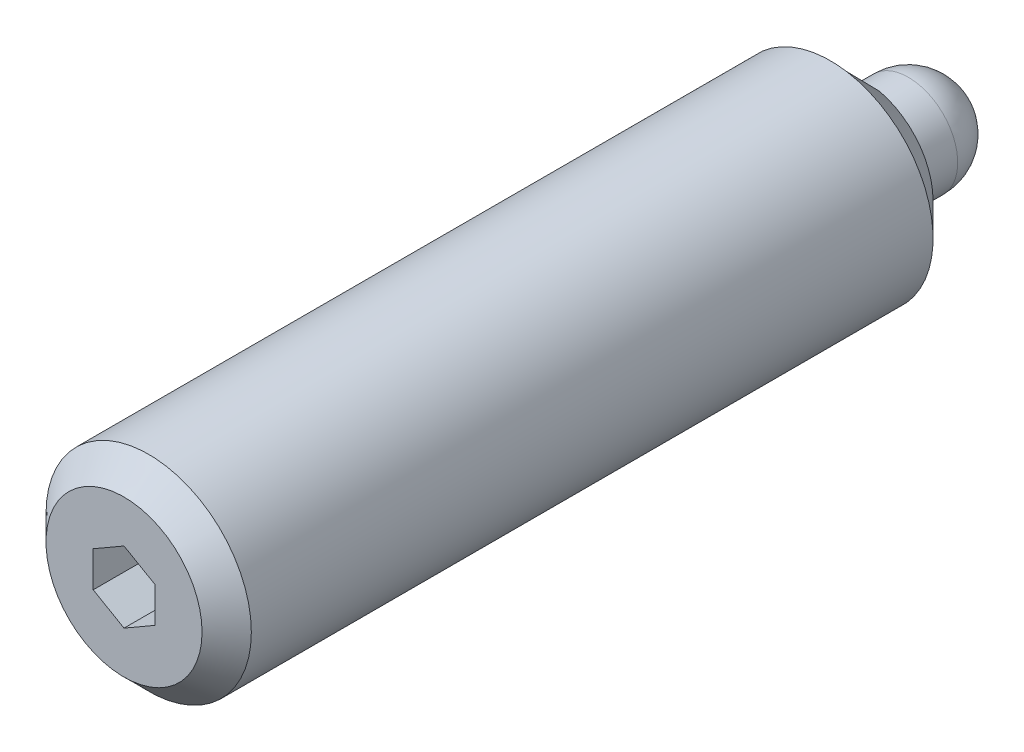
ISO-10303-21;
HEADER;
FILE_DESCRIPTION(('STEP AP214'),'2;1');
FILE_NAME('part.step','',(''),(''),'','','');
FILE_SCHEMA(('AUTOMOTIVE_DESIGN { 1 0 10303 214 1 1 1 1 }'));
ENDSEC;
DATA;
#1=APPLICATION_CONTEXT('core data for automotive mechanical design processes');
#2=APPLICATION_PROTOCOL_DEFINITION('international standard','automotive_design',2000,#1);
#3=PRODUCT_CONTEXT('',#1,'mechanical');
#4=PRODUCT('Part','Part','',(#3));
#5=PRODUCT_RELATED_PRODUCT_CATEGORY('part','',(#4));
#6=PRODUCT_DEFINITION_FORMATION('','',#4);
#7=PRODUCT_DEFINITION_CONTEXT('part definition',#1,'design');
#8=PRODUCT_DEFINITION('design','',#6,#7);
#9=PRODUCT_DEFINITION_SHAPE('','',#8);
#10=(LENGTH_UNIT() NAMED_UNIT(*) SI_UNIT(.MILLI.,.METRE.));
#11=(NAMED_UNIT(*) PLANE_ANGLE_UNIT() SI_UNIT($,.RADIAN.));
#12=(NAMED_UNIT(*) SI_UNIT($,.STERADIAN.) SOLID_ANGLE_UNIT());
#13=UNCERTAINTY_MEASURE_WITH_UNIT(LENGTH_MEASURE(1.E-05),#10,'distance_accuracy_value','');
#14=(GEOMETRIC_REPRESENTATION_CONTEXT(3) GLOBAL_UNCERTAINTY_ASSIGNED_CONTEXT((#13)) GLOBAL_UNIT_ASSIGNED_CONTEXT((#10,
#11,#12)) REPRESENTATION_CONTEXT('',''));
#15=CARTESIAN_POINT('',(0.,0.,0.));
#16=DIRECTION('',(0.,0.,1.));
#17=DIRECTION('',(1.,0.,0.));
#18=AXIS2_PLACEMENT_3D('',#15,#16,#17);
#19=CARTESIAN_POINT('',(0.,1.2,2.3));
#20=DIRECTION('',(0.,0.,-1.));
#21=DIRECTION('',(-1.,0.,0.));
#22=AXIS2_PLACEMENT_3D('',#19,#20,#21);
#23=PLANE('',#22);
#24=DIRECTION('',(0.,-1.,0.));
#25=VECTOR('',#24,1.);
#26=CARTESIAN_POINT('',(0.4,-1.13137084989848,2.3));
#27=LINE('',#26,#25);
#28=CARTESIAN_POINT('',(0.4,-1.13137084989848,2.3));
#29=VERTEX_POINT('',#28);
#30=CARTESIAN_POINT('',(0.4,-1.65227116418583,2.3));
#31=VERTEX_POINT('',#30);
#32=EDGE_CURVE('E129',#29,#31,#27,.T.);
#33=ORIENTED_EDGE('',*,*,#32,.F.);
#34=CARTESIAN_POINT('',(0.,0.,2.3));
#35=DIRECTION('',(0.,0.,-1.));
#36=DIRECTION('',(-1.,0.,0.));
#37=AXIS2_PLACEMENT_3D('',#34,#35,#36);
#38=CIRCLE('',#37,1.2);
#39=CARTESIAN_POINT('',(0.4,1.13137084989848,2.3));
#40=VERTEX_POINT('',#39);
#41=EDGE_CURVE('E218',#40,#29,#38,.T.);
#42=ORIENTED_EDGE('',*,*,#41,.F.);
#43=DIRECTION('',(0.,-1.,0.));
#44=VECTOR('',#43,1.);
#45=CARTESIAN_POINT('',(0.4,2.66147052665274,2.3));
#46=LINE('',#45,#44);
#47=CARTESIAN_POINT('',(0.4,1.65227116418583,2.3));
#48=VERTEX_POINT('',#47);
#49=EDGE_CURVE('E148',#48,#40,#46,.T.);
#50=ORIENTED_EDGE('',*,*,#49,.F.);
#51=CARTESIAN_POINT('',(0.,0.,2.3));
#52=DIRECTION('',(0.,0.,-1.));
#53=DIRECTION('',(-1.,0.,0.));
#54=AXIS2_PLACEMENT_3D('',#51,#52,#53);
#55=CIRCLE('',#54,1.7);
#56=EDGE_CURVE('E221',#48,#31,#55,.T.);
#57=ORIENTED_EDGE('',*,*,#56,.T.);
#58=EDGE_LOOP('',(#33,#42,#50,#57));
#59=FACE_BOUND('',#58,.T.);
#60=ADVANCED_FACE('F14',(#59),#23,.T.);
#61=CARTESIAN_POINT('',(0.,0.,2.3));
#62=DIRECTION('',(0.,0.,1.));
#63=DIRECTION('',(1.,0.,0.));
#64=AXIS2_PLACEMENT_3D('',#61,#62,#63);
#65=CONICAL_SURFACE('',#64,1.7,0.785398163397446);
#66=CARTESIAN_POINT('',(0.4,-0.191542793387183,1.04349593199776));
#67=CARTESIAN_POINT('',(0.4,-0.207169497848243,1.05025345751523));
#68=CARTESIAN_POINT('',(0.4,-0.222543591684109,1.0575560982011));
#69=CARTESIAN_POINT('',(0.4,-0.252830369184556,1.07302458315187));
#70=CARTESIAN_POINT('',(0.4,-0.267743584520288,1.08118938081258));
#71=CARTESIAN_POINT('',(0.4,-0.311804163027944,1.10660136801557));
#72=CARTESIAN_POINT('',(0.4,-0.340386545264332,1.12481911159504));
#73=CARTESIAN_POINT('',(0.4,-0.396328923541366,1.16272382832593));
#74=CARTESIAN_POINT('',(0.4,-0.423694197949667,1.18240320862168));
#75=CARTESIAN_POINT('',(0.4,-0.477696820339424,1.22279626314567));
#76=CARTESIAN_POINT('',(0.4,-0.504333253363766,1.24351115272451));
#77=CARTESIAN_POINT('',(0.4,-0.582677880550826,1.30606006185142));
#78=CARTESIAN_POINT('',(0.4,-0.633607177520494,1.34886298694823));
#79=CARTESIAN_POINT('',(0.4,-0.734309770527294,1.43581262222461));
#80=CARTESIAN_POINT('',(0.4,-0.784082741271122,1.4799597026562));
#81=CARTESIAN_POINT('',(0.4,-0.882911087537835,1.56905853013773));
#82=CARTESIAN_POINT('',(0.4,-0.931966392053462,1.61401035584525));
#83=CARTESIAN_POINT('',(0.4,-1.02959776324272,1.70441687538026));
#84=CARTESIAN_POINT('',(0.4,-1.07817389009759,1.74987150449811));
#85=CARTESIAN_POINT('',(0.4,-1.22393832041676,1.88722420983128));
#86=CARTESIAN_POINT('',(0.4,-1.32064296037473,1.97963490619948));
#87=CARTESIAN_POINT('',(0.4,-1.51336883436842,2.16512702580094));
#88=CARTESIAN_POINT('',(0.4,-1.60939019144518,2.25820832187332));
#89=CARTESIAN_POINT('',(0.4,-1.7416596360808,2.38698356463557));
#90=CARTESIAN_POINT('',(0.4,-1.77808020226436,2.42250037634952));
#91=CARTESIAN_POINT('',(0.4,-1.85082095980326,2.4935356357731));
#92=CARTESIAN_POINT('',(0.4,-1.88714122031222,2.52905401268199));
#93=CARTESIAN_POINT('',(0.4,-2.06005543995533,2.69834373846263));
#94=CARTESIAN_POINT('',(0.4,-2.19638243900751,2.83238773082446));
#95=CARTESIAN_POINT('',(0.4,-2.46871289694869,3.10080511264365));
#96=CARTESIAN_POINT('',(0.4,-2.60471635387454,3.23517850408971));
#97=CARTESIAN_POINT('',(0.4,-2.87740114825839,3.5050031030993));
#98=CARTESIAN_POINT('',(0.4,-3.01408116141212,3.64045564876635));
#99=CARTESIAN_POINT('',(0.4,-3.28729767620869,3.91150273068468));
#100=CARTESIAN_POINT('',(0.4,-3.42383417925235,4.04709726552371));
#101=CARTESIAN_POINT('',(0.4,-3.56033160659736,4.18273096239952));
#102=B_SPLINE_CURVE_WITH_KNOTS('',3,(#66,#67,#68,#69,#70,#71,#72,#73,#74,#75,#76,#77,#78,#79,
#80,#81,#82,#83,#84,#85,#86,#87,#88,#89,#90,#91,#92,#93,#94,#95,#96,#97,#98,#99,#100,#101),
.UNSPECIFIED.,.F.,.F.,(4,2,2,2,2,2,2,2,2,2,2,2,2,2,2,2,2,4),(0.,0.0510423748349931,
0.102023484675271,0.203610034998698,0.304701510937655,0.405914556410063,0.605442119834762,
0.805025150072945,1.00462779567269,1.20420504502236,1.60547397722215,2.00666872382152,
2.1592829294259,2.31168514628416,2.88524779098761,3.45881390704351,4.03609997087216,
4.61338034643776),.UNSPECIFIED.);
#103=CARTESIAN_POINT('',(0.4,-2.46779253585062,3.1));
#104=VERTEX_POINT('',#103);
#105=EDGE_CURVE('E9',#31,#104,#102,.T.);
#106=ORIENTED_EDGE('',*,*,#105,.F.);
#107=ORIENTED_EDGE('',*,*,#56,.F.);
#108=CARTESIAN_POINT('',(0.4,3.24418869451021,3.86875515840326));
#109=CARTESIAN_POINT('',(0.4,3.11988874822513,3.74540033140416));
#110=CARTESIAN_POINT('',(0.4,2.995545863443,3.62208860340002));
#111=CARTESIAN_POINT('',(0.4,2.74671089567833,3.37562755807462));
#112=CARTESIAN_POINT('',(0.4,2.62221882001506,3.25247823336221));
#113=CARTESIAN_POINT('',(0.4,2.37304205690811,3.00643777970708));
#114=CARTESIAN_POINT('',(0.4,2.24835742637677,2.88354659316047));
#115=CARTESIAN_POINT('',(0.4,1.99862225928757,2.63812396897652));
#116=CARTESIAN_POINT('',(0.4,1.87357170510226,2.51559254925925));
#117=CARTESIAN_POINT('',(0.4,1.65089891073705,2.29852648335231));
#118=CARTESIAN_POINT('',(0.4,1.5534018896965,2.20386364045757));
#119=CARTESIAN_POINT('',(0.4,1.40667255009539,2.06238260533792));
#120=CARTESIAN_POINT('',(0.4,1.35768510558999,2.01531062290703));
#121=CARTESIAN_POINT('',(0.4,1.25948508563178,1.92139904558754));
#122=CARTESIAN_POINT('',(0.4,1.21027250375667,1.8745594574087));
#123=CARTESIAN_POINT('',(0.4,1.1115171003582,1.78119031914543));
#124=CARTESIAN_POINT('',(0.4,1.06197415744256,1.73466089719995));
#125=CARTESIAN_POINT('',(0.4,0.962439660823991,1.64209157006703));
#126=CARTESIAN_POINT('',(0.4,0.912448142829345,1.59605162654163));
#127=CARTESIAN_POINT('',(0.4,0.811756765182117,1.50470679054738));
#128=CARTESIAN_POINT('',(0.4,0.761056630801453,1.45940219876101));
#129=CARTESIAN_POINT('',(0.4,0.684153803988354,1.39240692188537));
#130=CARTESIAN_POINT('',(0.4,0.658373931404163,1.37023254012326));
#131=CARTESIAN_POINT('',(0.4,0.606426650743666,1.32633704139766));
#132=CARTESIAN_POINT('',(0.4,0.580259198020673,1.30461597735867));
#133=CARTESIAN_POINT('',(0.4,0.55384820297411,1.2831894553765));
#134=B_SPLINE_CURVE_WITH_KNOTS('',3,(#108,#109,#110,#111,#112,#113,#114,#115,#116,#117,#118,
#119,#120,#121,#122,#123,#124,#125,#126,#127,#128,#129,#130,#131,#132,#133),.UNSPECIFIED.,.F.,
.F.,(4,2,2,2,2,2,2,2,2,2,2,2,4),(0.,0.525359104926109,1.05069341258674,1.57589437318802,
2.10112106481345,2.50879579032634,2.71260856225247,2.91642718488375,3.12032535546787,
3.32420743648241,3.52817088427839,3.63017980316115,3.73220056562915),.UNSPECIFIED.);
#135=CARTESIAN_POINT('',(0.4,2.46779253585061,3.1));
#136=VERTEX_POINT('',#135);
#137=EDGE_CURVE('E242',#136,#48,#134,.T.);
#138=ORIENTED_EDGE('',*,*,#137,.F.);
#139=CARTESIAN_POINT('',(0.,0.,3.1));
#140=DIRECTION('',(0.,0.,-1.));
#141=DIRECTION('',(-1.,0.,0.));
#142=AXIS2_PLACEMENT_3D('',#139,#140,#141);
#143=CIRCLE('',#142,2.5);
#144=EDGE_CURVE('E224',#104,#136,#143,.F.);
#145=ORIENTED_EDGE('',*,*,#144,.F.);
#146=EDGE_LOOP('',(#106,#107,#138,#145));
#147=FACE_BOUND('',#146,.T.);
#148=ADVANCED_FACE('F304',(#147),#65,.T.);
#149=CARTESIAN_POINT('',(0.,2.5,20.3));
#150=DIRECTION('',(0.,0.,1.));
#151=DIRECTION('',(1.,0.,0.));
#152=AXIS2_PLACEMENT_3D('',#149,#150,#151);
#153=PLANE('',#152);
#154=CARTESIAN_POINT('',(0.,0.,20.3));
#155=DIRECTION('',(0.,0.,1.));
#156=DIRECTION('',(1.,0.,0.));
#157=AXIS2_PLACEMENT_3D('',#154,#155,#156);
#158=CIRCLE('',#157,1.9);
#159=CARTESIAN_POINT('',(1.9,0.,20.3));
#160=VERTEX_POINT('',#159);
#161=EDGE_CURVE('E232',#160,#160,#158,.T.);
#162=ORIENTED_EDGE('',*,*,#161,.T.);
#163=EDGE_LOOP('',(#162));
#164=FACE_BOUND('',#163,.T.);
#165=DIRECTION('',(0.866025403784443,-0.499999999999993,0.));
#166=VECTOR('',#165,1.);
#167=CARTESIAN_POINT('',(-0.75,-0.433012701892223,20.3));
#168=LINE('',#167,#166);
#169=CARTESIAN_POINT('',(-0.75,-0.433012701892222,20.3));
#170=VERTEX_POINT('',#169);
#171=CARTESIAN_POINT('',(0.,-0.866025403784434,20.3));
#172=VERTEX_POINT('',#171);
#173=EDGE_CURVE('E180',#170,#172,#168,.T.);
#174=ORIENTED_EDGE('',*,*,#173,.F.);
#175=DIRECTION('',(0.,1.,0.));
#176=VECTOR('',#175,1.);
#177=CARTESIAN_POINT('',(-0.75,-0.433012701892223,20.3));
#178=LINE('',#177,#176);
#179=CARTESIAN_POINT('',(-0.75,0.433012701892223,20.3));
#180=VERTEX_POINT('',#179);
#181=EDGE_CURVE('E163',#170,#180,#178,.T.);
#182=ORIENTED_EDGE('',*,*,#181,.T.);
#183=DIRECTION('',(0.866025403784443,0.499999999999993,0.));
#184=VECTOR('',#183,1.);
#185=CARTESIAN_POINT('',(-0.75,0.433012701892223,20.3));
#186=LINE('',#185,#184);
#187=CARTESIAN_POINT('',(0.,0.866025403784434,20.3));
#188=VERTEX_POINT('',#187);
#189=EDGE_CURVE('E168',#180,#188,#186,.T.);
#190=ORIENTED_EDGE('',*,*,#189,.T.);
#191=DIRECTION('',(-0.866025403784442,0.499999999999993,0.));
#192=VECTOR('',#191,1.);
#193=CARTESIAN_POINT('',(0.75,0.433012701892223,20.3));
#194=LINE('',#193,#192);
#195=CARTESIAN_POINT('',(0.75,0.433012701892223,20.3));
#196=VERTEX_POINT('',#195);
#197=EDGE_CURVE('E171',#196,#188,#194,.T.);
#198=ORIENTED_EDGE('',*,*,#197,.F.);
#199=DIRECTION('',(0.,1.,0.));
#200=VECTOR('',#199,1.);
#201=CARTESIAN_POINT('',(0.75,-0.433012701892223,20.3));
#202=LINE('',#201,#200);
#203=CARTESIAN_POINT('',(0.75,-0.433012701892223,20.3));
#204=VERTEX_POINT('',#203);
#205=EDGE_CURVE('E174',#204,#196,#202,.T.);
#206=ORIENTED_EDGE('',*,*,#205,.F.);
#207=DIRECTION('',(-0.866025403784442,-0.499999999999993,0.));
#208=VECTOR('',#207,1.);
#209=CARTESIAN_POINT('',(0.75,-0.433012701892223,20.3));
#210=LINE('',#209,#208);
#211=EDGE_CURVE('E177',#204,#172,#210,.T.);
#212=ORIENTED_EDGE('',*,*,#211,.T.);
#213=EDGE_LOOP('',(#174,#182,#190,#198,#206,#212));
#214=FACE_BOUND('',#213,.T.);
#215=ADVANCED_FACE('F302',(#164,#214),#153,.T.);
#216=CARTESIAN_POINT('',(0.,0.,1.2));
#217=DIRECTION('',(-1.,0.,0.));
#218=DIRECTION('',(0.,0.,1.));
#219=AXIS2_PLACEMENT_3D('',#216,#217,#218);
#220=SPHERICAL_SURFACE('',#219,1.2);
#221=CARTESIAN_POINT('',(0.,0.,1.2));
#222=DIRECTION('',(0.,0.,-1.));
#223=DIRECTION('',(-1.,0.,0.));
#224=AXIS2_PLACEMENT_3D('',#221,#222,#223);
#225=SPHERICAL_SURFACE('',#224,1.2);
#226=CARTESIAN_POINT('',(0.,0.,1.2));
#227=DIRECTION('',(0.,0.,-1.));
#228=DIRECTION('',(-1.,0.,0.));
#229=AXIS2_PLACEMENT_3D('',#226,#227,#228);
#230=CIRCLE('',#229,1.2);
#231=CARTESIAN_POINT('',(-1.2,0.,1.2));
#232=VERTEX_POINT('',#231);
#233=EDGE_CURVE('E214',#232,#232,#230,.T.);
#234=ORIENTED_EDGE('',*,*,#233,.T.);
#235=EDGE_LOOP('',(#234));
#236=FACE_BOUND('',#235,.T.);
#237=ADVANCED_FACE('F300',(#236),#225,.T.);
#238=CARTESIAN_POINT('',(0.,0.,0.3));
#239=DIRECTION('',(0.,0.,-1.));
#240=DIRECTION('',(-1.,0.,0.));
#241=AXIS2_PLACEMENT_3D('',#238,#239,#240);
#242=CYLINDRICAL_SURFACE('',#241,2.5);
#243=CARTESIAN_POINT('',(0.,0.,19.7));
#244=DIRECTION('',(0.,0.,1.));
#245=DIRECTION('',(1.,0.,0.));
#246=AXIS2_PLACEMENT_3D('',#243,#244,#245);
#247=CIRCLE('',#246,2.5);
#248=CARTESIAN_POINT('',(2.5,0.,19.7));
#249=VERTEX_POINT('',#248);
#250=EDGE_CURVE('E228',#249,#249,#247,.F.);
#251=ORIENTED_EDGE('',*,*,#250,.T.);
#252=EDGE_LOOP('',(#251));
#253=FACE_BOUND('',#252,.T.);
#254=CARTESIAN_POINT('',(-0.4,2.46779253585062,3.1));
#255=VERTEX_POINT('',#254);
#256=EDGE_CURVE('E225',#136,#255,#143,.F.);
#257=ORIENTED_EDGE('',*,*,#256,.T.);
#258=CARTESIAN_POINT('',(-0.4,-2.46779253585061,3.1));
#259=VERTEX_POINT('',#258);
#260=EDGE_CURVE('E229',#255,#259,#143,.F.);
#261=ORIENTED_EDGE('',*,*,#260,.T.);
#262=EDGE_CURVE('E126',#259,#104,#143,.F.);
#263=ORIENTED_EDGE('',*,*,#262,.T.);
#264=ORIENTED_EDGE('',*,*,#144,.T.);
#265=EDGE_LOOP('',(#257,#261,#263,#264));
#266=FACE_BOUND('',#265,.T.);
#267=ADVANCED_FACE('F296',(#253,#266),#242,.T.);
#268=DIRECTION('',(0.,1.,0.));
#269=VECTOR('',#268,1.);
#270=CARTESIAN_POINT('',(-0.4,-1.13137084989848,2.3));
#271=LINE('',#270,#269);
#272=CARTESIAN_POINT('',(-0.4,-1.65227116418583,2.3));
#273=VERTEX_POINT('',#272);
#274=CARTESIAN_POINT('',(-0.4,-1.13137084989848,2.3));
#275=VERTEX_POINT('',#274);
#276=EDGE_CURVE('E135',#273,#275,#271,.T.);
#277=ORIENTED_EDGE('',*,*,#276,.F.);
#278=CARTESIAN_POINT('',(-0.4,1.65227116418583,2.3));
#279=VERTEX_POINT('',#278);
#280=EDGE_CURVE('E220',#273,#279,#55,.T.);
#281=ORIENTED_EDGE('',*,*,#280,.T.);
#282=DIRECTION('',(0.,1.,0.));
#283=VECTOR('',#282,1.);
#284=CARTESIAN_POINT('',(-0.4,2.66147052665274,2.3));
#285=LINE('',#284,#283);
#286=CARTESIAN_POINT('',(-0.4,1.13137084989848,2.3));
#287=VERTEX_POINT('',#286);
#288=EDGE_CURVE('E153',#287,#279,#285,.T.);
#289=ORIENTED_EDGE('',*,*,#288,.F.);
#290=EDGE_CURVE('E217',#275,#287,#38,.T.);
#291=ORIENTED_EDGE('',*,*,#290,.F.);
#292=EDGE_LOOP('',(#277,#281,#289,#291));
#293=FACE_BOUND('',#292,.T.);
#294=ADVANCED_FACE('F293',(#293),#23,.T.);
#295=CARTESIAN_POINT('',(0.,0.,0.3));
#296=DIRECTION('',(0.,0.,-1.));
#297=DIRECTION('',(-1.,0.,0.));
#298=AXIS2_PLACEMENT_3D('',#295,#296,#297);
#299=CYLINDRICAL_SURFACE('',#298,1.2);
#300=ORIENTED_EDGE('',*,*,#41,.T.);
#301=DIRECTION('',(0.,0.,-1.));
#302=VECTOR('',#301,1.);
#303=CARTESIAN_POINT('',(0.4,-1.13137084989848,3.1));
#304=LINE('',#303,#302);
#305=CARTESIAN_POINT('',(0.4,-1.13137084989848,3.1));
#306=VERTEX_POINT('',#305);
#307=EDGE_CURVE('E138',#306,#29,#304,.T.);
#308=ORIENTED_EDGE('',*,*,#307,.F.);
#309=CARTESIAN_POINT('',(0.,0.,3.1));
#310=DIRECTION('',(0.,0.,1.));
#311=DIRECTION('',(-1.,0.,0.));
#312=AXIS2_PLACEMENT_3D('',#309,#310,#311);
#313=CIRCLE('',#312,1.2);
#314=CARTESIAN_POINT('',(-0.4,-1.13137084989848,3.1));
#315=VERTEX_POINT('',#314);
#316=EDGE_CURVE('E124',#315,#306,#313,.T.);
#317=ORIENTED_EDGE('',*,*,#316,.F.);
#318=DIRECTION('',(0.,0.,-1.));
#319=VECTOR('',#318,1.);
#320=CARTESIAN_POINT('',(-0.4,-1.13137084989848,3.1));
#321=LINE('',#320,#319);
#322=EDGE_CURVE('E132',#315,#275,#321,.T.);
#323=ORIENTED_EDGE('',*,*,#322,.T.);
#324=ORIENTED_EDGE('',*,*,#290,.T.);
#325=DIRECTION('',(0.,0.,-1.));
#326=VECTOR('',#325,1.);
#327=CARTESIAN_POINT('',(-0.4,1.13137084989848,3.1));
#328=LINE('',#327,#326);
#329=CARTESIAN_POINT('',(-0.4,1.13137084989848,3.1));
#330=VERTEX_POINT('',#329);
#331=EDGE_CURVE('E160',#330,#287,#328,.T.);
#332=ORIENTED_EDGE('',*,*,#331,.F.);
#333=CARTESIAN_POINT('',(0.,0.,3.1));
#334=DIRECTION('',(0.,0.,1.));
#335=DIRECTION('',(-1.,0.,0.));
#336=AXIS2_PLACEMENT_3D('',#333,#334,#335);
#337=CIRCLE('',#336,1.2);
#338=CARTESIAN_POINT('',(0.4,1.13137084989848,3.1));
#339=VERTEX_POINT('',#338);
#340=EDGE_CURVE('E152',#339,#330,#337,.T.);
#341=ORIENTED_EDGE('',*,*,#340,.F.);
#342=DIRECTION('',(0.,0.,-1.));
#343=VECTOR('',#342,1.);
#344=CARTESIAN_POINT('',(0.4,1.13137084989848,3.1));
#345=LINE('',#344,#343);
#346=EDGE_CURVE('E156',#339,#40,#345,.T.);
#347=ORIENTED_EDGE('',*,*,#346,.T.);
#348=EDGE_LOOP('',(#300,#308,#317,#323,#324,#332,#341,#347));
#349=FACE_BOUND('',#348,.T.);
#350=ORIENTED_EDGE('',*,*,#233,.F.);
#351=EDGE_LOOP('',(#350));
#352=FACE_BOUND('',#351,.T.);
#353=ADVANCED_FACE('F141',(#349,#352),#299,.T.);
#354=CARTESIAN_POINT('',(-0.75,-0.433012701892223,18.3));
#355=DIRECTION('',(1.,0.,0.));
#356=DIRECTION('',(0.,0.,-1.));
#357=AXIS2_PLACEMENT_3D('',#354,#355,#356);
#358=PLANE('',#357);
#359=DIRECTION('',(0.,0.,1.));
#360=VECTOR('',#359,1.);
#361=CARTESIAN_POINT('',(-0.75,0.433012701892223,18.3));
#362=LINE('',#361,#360);
#363=CARTESIAN_POINT('',(-0.75,0.433012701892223,18.3));
#364=VERTEX_POINT('',#363);
#365=EDGE_CURVE('E212',#364,#180,#362,.T.);
#366=ORIENTED_EDGE('',*,*,#365,.T.);
#367=ORIENTED_EDGE('',*,*,#181,.F.);
#368=DIRECTION('',(0.,0.,1.));
#369=VECTOR('',#368,1.);
#370=CARTESIAN_POINT('',(-0.75,-0.433012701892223,18.3));
#371=LINE('',#370,#369);
#372=CARTESIAN_POINT('',(-0.75,-0.433012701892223,18.3));
#373=VERTEX_POINT('',#372);
#374=EDGE_CURVE('E201',#373,#170,#371,.T.);
#375=ORIENTED_EDGE('',*,*,#374,.F.);
#376=DIRECTION('',(0.,1.,0.));
#377=VECTOR('',#376,1.);
#378=CARTESIAN_POINT('',(-0.75,-0.433012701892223,18.3));
#379=LINE('',#378,#377);
#380=EDGE_CURVE('E183',#373,#364,#379,.T.);
#381=ORIENTED_EDGE('',*,*,#380,.T.);
#382=EDGE_LOOP('',(#366,#367,#375,#381));
#383=FACE_BOUND('',#382,.T.);
#384=ADVANCED_FACE('F269',(#383),#358,.T.);
#385=CARTESIAN_POINT('',(-0.75,0.433012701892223,18.3));
#386=DIRECTION('',(0.499999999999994,-0.866025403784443,0.));
#387=DIRECTION('',(0.866025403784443,0.499999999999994,0.));
#388=AXIS2_PLACEMENT_3D('',#385,#386,#387);
#389=PLANE('',#388);
#390=DIRECTION('',(0.,0.,1.));
#391=VECTOR('',#390,1.);
#392=CARTESIAN_POINT('',(0.,0.866025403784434,18.3));
#393=LINE('',#392,#391);
#394=CARTESIAN_POINT('',(0.,0.866025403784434,18.3));
#395=VERTEX_POINT('',#394);
#396=EDGE_CURVE('E210',#395,#188,#393,.T.);
#397=ORIENTED_EDGE('',*,*,#396,.T.);
#398=ORIENTED_EDGE('',*,*,#189,.F.);
#399=ORIENTED_EDGE('',*,*,#365,.F.);
#400=DIRECTION('',(0.866025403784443,0.499999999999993,0.));
#401=VECTOR('',#400,1.);
#402=CARTESIAN_POINT('',(-0.75,0.433012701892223,18.3));
#403=LINE('',#402,#401);
#404=EDGE_CURVE('E186',#364,#395,#403,.T.);
#405=ORIENTED_EDGE('',*,*,#404,.T.);
#406=EDGE_LOOP('',(#397,#398,#399,#405));
#407=FACE_BOUND('',#406,.T.);
#408=ADVANCED_FACE('F272',(#407),#389,.T.);
#409=CARTESIAN_POINT('',(0.75,0.433012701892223,18.3));
#410=DIRECTION('',(0.499999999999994,0.866025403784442,0.));
#411=DIRECTION('',(-0.866025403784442,0.499999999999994,0.));
#412=AXIS2_PLACEMENT_3D('',#409,#410,#411);
#413=PLANE('',#412);
#414=DIRECTION('',(0.,0.,1.));
#415=VECTOR('',#414,1.);
#416=CARTESIAN_POINT('',(0.75,0.433012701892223,18.3));
#417=LINE('',#416,#415);
#418=CARTESIAN_POINT('',(0.75,0.433012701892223,18.3));
#419=VERTEX_POINT('',#418);
#420=EDGE_CURVE('E208',#419,#196,#417,.T.);
#421=ORIENTED_EDGE('',*,*,#420,.T.);
#422=ORIENTED_EDGE('',*,*,#197,.T.);
#423=ORIENTED_EDGE('',*,*,#396,.F.);
#424=DIRECTION('',(-0.866025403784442,0.499999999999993,0.));
#425=VECTOR('',#424,1.);
#426=CARTESIAN_POINT('',(0.75,0.433012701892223,18.3));
#427=LINE('',#426,#425);
#428=EDGE_CURVE('E189',#419,#395,#427,.T.);
#429=ORIENTED_EDGE('',*,*,#428,.F.);
#430=EDGE_LOOP('',(#421,#422,#423,#429));
#431=FACE_BOUND('',#430,.T.);
#432=ADVANCED_FACE('F283',(#431),#413,.F.);
#433=CARTESIAN_POINT('',(0.75,-0.433012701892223,18.3));
#434=DIRECTION('',(1.,0.,0.));
#435=DIRECTION('',(0.,0.,-1.));
#436=AXIS2_PLACEMENT_3D('',#433,#434,#435);
#437=PLANE('',#436);
#438=DIRECTION('',(0.,0.,1.));
#439=VECTOR('',#438,1.);
#440=CARTESIAN_POINT('',(0.75,-0.433012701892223,18.3));
#441=LINE('',#440,#439);
#442=CARTESIAN_POINT('',(0.75,-0.433012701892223,18.3));
#443=VERTEX_POINT('',#442);
#444=EDGE_CURVE('E206',#443,#204,#441,.T.);
#445=ORIENTED_EDGE('',*,*,#444,.T.);
#446=ORIENTED_EDGE('',*,*,#205,.T.);
#447=ORIENTED_EDGE('',*,*,#420,.F.);
#448=DIRECTION('',(0.,1.,0.));
#449=VECTOR('',#448,1.);
#450=CARTESIAN_POINT('',(0.75,-0.433012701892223,18.3));
#451=LINE('',#450,#449);
#452=EDGE_CURVE('E192',#443,#419,#451,.T.);
#453=ORIENTED_EDGE('',*,*,#452,.F.);
#454=EDGE_LOOP('',(#445,#446,#447,#453));
#455=FACE_BOUND('',#454,.T.);
#456=ADVANCED_FACE('F279',(#455),#437,.F.);
#457=CARTESIAN_POINT('',(0.75,-0.433012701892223,18.3));
#458=DIRECTION('',(-0.499999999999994,0.866025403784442,0.));
#459=DIRECTION('',(-0.866025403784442,-0.499999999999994,0.));
#460=AXIS2_PLACEMENT_3D('',#457,#458,#459);
#461=PLANE('',#460);
#462=DIRECTION('',(0.,0.,1.));
#463=VECTOR('',#462,1.);
#464=CARTESIAN_POINT('',(0.,-0.866025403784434,18.3));
#465=LINE('',#464,#463);
#466=CARTESIAN_POINT('',(0.,-0.866025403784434,18.3));
#467=VERTEX_POINT('',#466);
#468=EDGE_CURVE('E204',#467,#172,#465,.T.);
#469=ORIENTED_EDGE('',*,*,#468,.T.);
#470=ORIENTED_EDGE('',*,*,#211,.F.);
#471=ORIENTED_EDGE('',*,*,#444,.F.);
#472=DIRECTION('',(-0.866025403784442,-0.499999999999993,0.));
#473=VECTOR('',#472,1.);
#474=CARTESIAN_POINT('',(0.75,-0.433012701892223,18.3));
#475=LINE('',#474,#473);
#476=EDGE_CURVE('E195',#443,#467,#475,.T.);
#477=ORIENTED_EDGE('',*,*,#476,.T.);
#478=EDGE_LOOP('',(#469,#470,#471,#477));
#479=FACE_BOUND('',#478,.T.);
#480=ADVANCED_FACE('F268',(#479),#461,.T.);
#481=CARTESIAN_POINT('',(-0.75,-0.433012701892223,18.3));
#482=DIRECTION('',(-0.499999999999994,-0.866025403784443,0.));
#483=DIRECTION('',(0.866025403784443,-0.499999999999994,0.));
#484=AXIS2_PLACEMENT_3D('',#481,#482,#483);
#485=PLANE('',#484);
#486=DIRECTION('',(0.866025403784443,-0.499999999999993,0.));
#487=VECTOR('',#486,1.);
#488=CARTESIAN_POINT('',(-0.75,-0.433012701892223,18.3));
#489=LINE('',#488,#487);
#490=EDGE_CURVE('E198',#373,#467,#489,.T.);
#491=ORIENTED_EDGE('',*,*,#490,.F.);
#492=ORIENTED_EDGE('',*,*,#374,.T.);
#493=ORIENTED_EDGE('',*,*,#173,.T.);
#494=ORIENTED_EDGE('',*,*,#468,.F.);
#495=EDGE_LOOP('',(#491,#492,#493,#494));
#496=FACE_BOUND('',#495,.T.);
#497=ADVANCED_FACE('F266',(#496),#485,.F.);
#498=CARTESIAN_POINT('',(-0.75,0.433012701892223,18.3));
#499=DIRECTION('',(0.,0.,-1.));
#500=DIRECTION('',(-1.,0.,0.));
#501=AXIS2_PLACEMENT_3D('',#498,#499,#500);
#502=PLANE('',#501);
#503=ORIENTED_EDGE('',*,*,#380,.F.);
#504=ORIENTED_EDGE('',*,*,#490,.T.);
#505=ORIENTED_EDGE('',*,*,#476,.F.);
#506=ORIENTED_EDGE('',*,*,#452,.T.);
#507=ORIENTED_EDGE('',*,*,#428,.T.);
#508=ORIENTED_EDGE('',*,*,#404,.F.);
#509=EDGE_LOOP('',(#503,#504,#505,#506,#507,#508));
#510=FACE_BOUND('',#509,.T.);
#511=ADVANCED_FACE('F263',(#510),#502,.F.);
#512=CARTESIAN_POINT('',(-0.4,-3.56033160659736,4.18273096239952));
#513=CARTESIAN_POINT('',(-0.4,-3.42419196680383,4.0474516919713));
#514=CARTESIAN_POINT('',(-0.4,-3.28801267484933,3.91221223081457));
#515=CARTESIAN_POINT('',(-0.4,-3.01555640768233,3.64191895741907));
#516=CARTESIAN_POINT('',(-0.4,-2.8792794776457,3.50686509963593));
#517=CARTESIAN_POINT('',(-0.4,-2.60664205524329,3.23708070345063));
#518=CARTESIAN_POINT('',(-0.4,-2.47028174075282,3.10234998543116));
#519=CARTESIAN_POINT('',(-0.4,-2.26547283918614,2.90048607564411));
#520=CARTESIAN_POINT('',(-0.4,-2.19714840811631,2.83322693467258));
#521=CARTESIAN_POINT('',(-0.4,-2.06038754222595,2.6988178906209));
#522=CARTESIAN_POINT('',(-0.4,-1.99195110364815,2.63166799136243));
#523=CARTESIAN_POINT('',(-0.4,-1.85480606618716,2.49739560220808));
#524=CARTESIAN_POINT('',(-0.4,-1.78609719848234,2.43027338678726));
#525=CARTESIAN_POINT('',(-0.4,-1.64848359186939,2.29624688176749));
#526=CARTESIAN_POINT('',(-0.4,-1.57957887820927,2.22934256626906));
#527=CARTESIAN_POINT('',(-0.4,-1.4415401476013,2.0959030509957));
#528=CARTESIAN_POINT('',(-0.4,-1.37240641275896,2.02936755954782));
#529=CARTESIAN_POINT('',(-0.4,-1.23366462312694,1.89672969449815));
#530=CARTESIAN_POINT('',(-0.4,-1.16405637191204,1.83062752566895));
#531=CARTESIAN_POINT('',(-0.4,-1.05898122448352,1.73194463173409));
#532=CARTESIAN_POINT('',(-0.4,-1.02378648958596,1.69907432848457));
#533=CARTESIAN_POINT('',(-0.4,-0.953156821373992,1.63360118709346));
#534=CARTESIAN_POINT('',(-0.4,-0.917721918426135,1.60099831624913));
#535=CARTESIAN_POINT('',(-0.4,-0.846574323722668,1.5362010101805));
#536=CARTESIAN_POINT('',(-0.4,-0.810862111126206,1.50400604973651));
#537=CARTESIAN_POINT('',(-0.4,-0.738963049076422,1.44011493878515));
#538=CARTESIAN_POINT('',(-0.4,-0.702775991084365,1.40841902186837));
#539=CARTESIAN_POINT('',(-0.4,-0.629548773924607,1.34563672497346));
#540=CARTESIAN_POINT('',(-0.4,-0.592505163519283,1.31455435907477));
#541=CARTESIAN_POINT('',(-0.4,-0.517451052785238,1.25365718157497));
#542=CARTESIAN_POINT('',(-0.4,-0.47944183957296,1.223840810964));
#543=CARTESIAN_POINT('',(-0.4,-0.421102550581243,1.18065322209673));
#544=CARTESIAN_POINT('',(-0.4,-0.401374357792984,1.16647354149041));
#545=CARTESIAN_POINT('',(-0.4,-0.361400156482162,1.13888837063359));
#546=CARTESIAN_POINT('',(-0.4,-0.341154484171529,1.12548239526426));
#547=CARTESIAN_POINT('',(-0.4,-0.299892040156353,1.099671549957));
#548=CARTESIAN_POINT('',(-0.4,-0.278872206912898,1.08727145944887));
#549=CARTESIAN_POINT('',(-0.4,-0.23592403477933,1.064051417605));
#550=CARTESIAN_POINT('',(-0.4,-0.213993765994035,1.0532350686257));
#551=CARTESIAN_POINT('',(-0.4,-0.191542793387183,1.04349593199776));
#552=B_SPLINE_CURVE_WITH_KNOTS('',3,(#512,#513,#514,#515,#516,#517,#518,#519,#520,#521,#522,
#523,#524,#525,#526,#527,#528,#529,#530,#531,#532,#533,#534,#535,#536,#537,#538,#539,#540,#541,
#542,#543,#544,#545,#546,#547,#548,#549,#550,#551),.UNSPECIFIED.,.F.,.F.,(4,2,2,2,2,2,2,2,2,2,2,
2,2,2,2,2,2,2,2,4),(0.,0.57576943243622,1.15135470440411,1.72643558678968,2.01406056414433,
2.30169539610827,2.58985600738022,2.87798101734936,3.16583064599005,3.45380770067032,
3.59827868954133,3.74273174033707,3.886974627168,4.03128313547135,4.17634011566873,
4.32121295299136,4.39408545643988,4.46691176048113,4.54006597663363,4.61338408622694),.UNSPECIFIED.);
#553=EDGE_CURVE('E27',#259,#273,#552,.T.);
#554=ORIENTED_EDGE('',*,*,#553,.F.);
#555=ORIENTED_EDGE('',*,*,#260,.F.);
#556=CARTESIAN_POINT('',(-0.4,0.553848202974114,1.28318945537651));
#557=CARTESIAN_POINT('',(-0.4,0.579799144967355,1.30424204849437));
#558=CARTESIAN_POINT('',(-0.4,0.605514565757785,1.32557961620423));
#559=CARTESIAN_POINT('',(-0.4,0.656569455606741,1.36869481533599));
#560=CARTESIAN_POINT('',(-0.4,0.681908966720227,1.39047239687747));
#561=CARTESIAN_POINT('',(-0.4,0.757501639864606,1.45626605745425));
#562=CARTESIAN_POINT('',(-0.4,0.807342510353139,1.50075427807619));
#563=CARTESIAN_POINT('',(-0.4,0.906328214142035,1.59045362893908));
#564=CARTESIAN_POINT('',(-0.4,0.955473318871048,1.63566446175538));
#565=CARTESIAN_POINT('',(-0.4,1.05332109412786,1.72656933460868));
#566=CARTESIAN_POINT('',(-0.4,1.10202372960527,1.77226341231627));
#567=CARTESIAN_POINT('',(-0.4,1.20082132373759,1.86558298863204));
#568=CARTESIAN_POINT('',(-0.4,1.25090530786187,1.91322008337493));
#569=CARTESIAN_POINT('',(-0.4,1.35083650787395,2.00873885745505));
#570=CARTESIAN_POINT('',(-0.4,1.40068373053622,2.05662052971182));
#571=CARTESIAN_POINT('',(-0.4,1.54999203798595,2.20055218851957));
#572=CARTESIAN_POINT('',(-0.4,1.64919725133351,2.29686742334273));
#573=CARTESIAN_POINT('',(-0.4,1.87362303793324,2.51564290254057));
#574=CARTESIAN_POINT('',(-0.4,1.99872492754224,2.63822464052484));
#575=CARTESIAN_POINT('',(-0.4,2.24856858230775,2.88375432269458));
#576=CARTESIAN_POINT('',(-0.4,2.37331034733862,3.00670226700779));
#577=CARTESIAN_POINT('',(-0.4,2.62249305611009,3.25274944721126));
#578=CARTESIAN_POINT('',(-0.4,2.746934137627,3.37584854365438));
#579=CARTESIAN_POINT('',(-0.4,2.99566068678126,3.62220244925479));
#580=CARTESIAN_POINT('',(-0.4,3.11994615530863,3.74545725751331));
#581=CARTESIAN_POINT('',(-0.4,3.24418869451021,3.86875515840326));
#582=B_SPLINE_CURVE_WITH_KNOTS('',3,(#556,#557,#558,#559,#560,#561,#562,#563,#564,#565,#566,
#567,#568,#569,#570,#571,#572,#573,#574,#575,#576,#577,#578,#579,#580,#581),.UNSPECIFIED.,.F.,
.F.,(4,2,2,2,2,2,2,2,2,2,2,2,4),(0.,0.100242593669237,0.200473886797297,0.400883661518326,
0.601212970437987,0.801558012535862,1.00891961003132,1.21627523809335,1.63107965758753,
2.1565220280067,2.68196458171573,3.20708416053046,3.7322007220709),.UNSPECIFIED.);
#583=EDGE_CURVE('E235',#279,#255,#582,.T.);
#584=ORIENTED_EDGE('',*,*,#583,.F.);
#585=ORIENTED_EDGE('',*,*,#280,.F.);
#586=EDGE_LOOP('',(#554,#555,#584,#585));
#587=FACE_BOUND('',#586,.T.);
#588=ADVANCED_FACE('F248',(#587),#65,.T.);
#589=CARTESIAN_POINT('',(0.,0.,19.7));
#590=DIRECTION('',(0.,0.,-1.));
#591=DIRECTION('',(-1.,0.,0.));
#592=AXIS2_PLACEMENT_3D('',#589,#590,#591);
#593=CONICAL_SURFACE('',#592,2.5,0.78539816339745);
#594=ORIENTED_EDGE('',*,*,#161,.F.);
#595=EDGE_LOOP('',(#594));
#596=FACE_BOUND('',#595,.T.);
#597=ORIENTED_EDGE('',*,*,#250,.F.);
#598=EDGE_LOOP('',(#597));
#599=FACE_BOUND('',#598,.T.);
#600=ADVANCED_FACE('F16',(#596,#599),#593,.T.);
#601=CARTESIAN_POINT('',(0.4,2.66147052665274,3.1));
#602=DIRECTION('',(1.,0.,0.));
#603=DIRECTION('',(0.,1.,0.));
#604=AXIS2_PLACEMENT_3D('',#601,#602,#603);
#605=PLANE('',#604);
#606=ORIENTED_EDGE('',*,*,#137,.T.);
#607=ORIENTED_EDGE('',*,*,#49,.T.);
#608=ORIENTED_EDGE('',*,*,#346,.F.);
#609=DIRECTION('',(0.,-1.,0.));
#610=VECTOR('',#609,1.);
#611=CARTESIAN_POINT('',(0.4,2.66147052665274,3.1));
#612=LINE('',#611,#610);
#613=EDGE_CURVE('E150',#136,#339,#612,.T.);
#614=ORIENTED_EDGE('',*,*,#613,.F.);
#615=EDGE_LOOP('',(#606,#607,#608,#614));
#616=FACE_BOUND('',#615,.T.);
#617=ADVANCED_FACE('F256',(#616),#605,.F.);
#618=CARTESIAN_POINT('',(-0.4,2.66147052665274,3.1));
#619=DIRECTION('',(-1.,0.,0.));
#620=DIRECTION('',(0.,-1.,0.));
#621=AXIS2_PLACEMENT_3D('',#618,#619,#620);
#622=PLANE('',#621);
#623=ORIENTED_EDGE('',*,*,#583,.T.);
#624=DIRECTION('',(0.,1.,0.));
#625=VECTOR('',#624,1.);
#626=CARTESIAN_POINT('',(-0.4,2.66147052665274,3.1));
#627=LINE('',#626,#625);
#628=EDGE_CURVE('E41',#330,#255,#627,.T.);
#629=ORIENTED_EDGE('',*,*,#628,.F.);
#630=ORIENTED_EDGE('',*,*,#331,.T.);
#631=ORIENTED_EDGE('',*,*,#288,.T.);
#632=EDGE_LOOP('',(#623,#629,#630,#631));
#633=FACE_BOUND('',#632,.T.);
#634=ADVANCED_FACE('F251',(#633),#622,.F.);
#635=CARTESIAN_POINT('',(0.,0.,3.1));
#636=DIRECTION('',(0.,0.,-1.));
#637=DIRECTION('',(-1.,0.,0.));
#638=AXIS2_PLACEMENT_3D('',#635,#636,#637);
#639=PLANE('',#638);
#640=ORIENTED_EDGE('',*,*,#613,.T.);
#641=ORIENTED_EDGE('',*,*,#340,.T.);
#642=ORIENTED_EDGE('',*,*,#628,.T.);
#643=ORIENTED_EDGE('',*,*,#256,.F.);
#644=EDGE_LOOP('',(#640,#641,#642,#643));
#645=FACE_BOUND('',#644,.T.);
#646=ADVANCED_FACE('F255',(#645),#639,.T.);
#647=CARTESIAN_POINT('',(0.4,-1.13137084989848,3.1));
#648=DIRECTION('',(1.,0.,0.));
#649=DIRECTION('',(0.,1.,0.));
#650=AXIS2_PLACEMENT_3D('',#647,#648,#649);
#651=PLANE('',#650);
#652=ORIENTED_EDGE('',*,*,#105,.T.);
#653=DIRECTION('',(0.,-1.,0.));
#654=VECTOR('',#653,1.);
#655=CARTESIAN_POINT('',(0.4,-1.13137084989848,3.1));
#656=LINE('',#655,#654);
#657=EDGE_CURVE('E34',#306,#104,#656,.T.);
#658=ORIENTED_EDGE('',*,*,#657,.F.);
#659=ORIENTED_EDGE('',*,*,#307,.T.);
#660=ORIENTED_EDGE('',*,*,#32,.T.);
#661=EDGE_LOOP('',(#652,#658,#659,#660));
#662=FACE_BOUND('',#661,.T.);
#663=ADVANCED_FACE('F330',(#662),#651,.F.);
#664=CARTESIAN_POINT('',(-0.4,-1.13137084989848,3.1));
#665=DIRECTION('',(-1.,0.,0.));
#666=DIRECTION('',(0.,-1.,0.));
#667=AXIS2_PLACEMENT_3D('',#664,#665,#666);
#668=PLANE('',#667);
#669=ORIENTED_EDGE('',*,*,#553,.T.);
#670=ORIENTED_EDGE('',*,*,#276,.T.);
#671=ORIENTED_EDGE('',*,*,#322,.F.);
#672=DIRECTION('',(0.,1.,0.));
#673=VECTOR('',#672,1.);
#674=CARTESIAN_POINT('',(-0.4,-1.13137084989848,3.1));
#675=LINE('',#674,#673);
#676=EDGE_CURVE('E120',#259,#315,#675,.T.);
#677=ORIENTED_EDGE('',*,*,#676,.F.);
#678=EDGE_LOOP('',(#669,#670,#671,#677));
#679=FACE_BOUND('',#678,.T.);
#680=ADVANCED_FACE('F133',(#679),#668,.F.);
#681=CARTESIAN_POINT('',(0.,0.,3.1));
#682=DIRECTION('',(0.,0.,-1.));
#683=DIRECTION('',(-1.,0.,0.));
#684=AXIS2_PLACEMENT_3D('',#681,#682,#683);
#685=PLANE('',#684);
#686=ORIENTED_EDGE('',*,*,#676,.T.);
#687=ORIENTED_EDGE('',*,*,#316,.T.);
#688=ORIENTED_EDGE('',*,*,#657,.T.);
#689=ORIENTED_EDGE('',*,*,#262,.F.);
#690=EDGE_LOOP('',(#686,#687,#688,#689));
#691=FACE_BOUND('',#690,.T.);
#692=ADVANCED_FACE('F122',(#691),#685,.T.);
#693=CLOSED_SHELL('',(#60,#148,#215,#237,#267,#294,#353,#384,#408,#432,#456,#480,#497,#511,#588,
#600,#617,#634,#646,#663,#680,#692));
#694=MANIFOLD_SOLID_BREP('B1',#693);
#695=ADVANCED_BREP_SHAPE_REPRESENTATION('',(#18,#694),#14);
#696=SHAPE_DEFINITION_REPRESENTATION(#9,#695);
ENDSEC;
END-ISO-10303-21;
